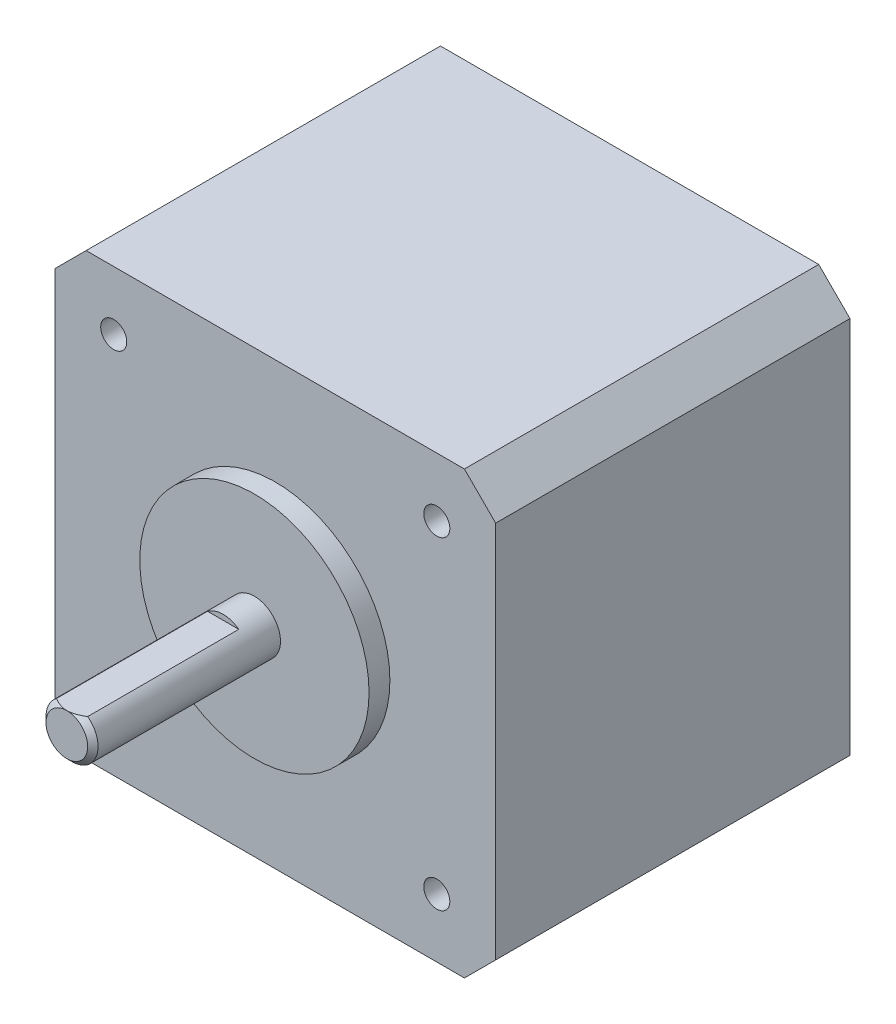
ISO-10303-21;
HEADER;
FILE_DESCRIPTION(('STEP AP214'),'2;1');
FILE_NAME('part.step','',(''),(''),'','','');
FILE_SCHEMA(('AUTOMOTIVE_DESIGN { 1 0 10303 214 1 1 1 1 }'));
ENDSEC;
DATA;
#1=APPLICATION_CONTEXT('core data for automotive mechanical design processes');
#2=APPLICATION_PROTOCOL_DEFINITION('international standard','automotive_design',2000,#1);
#3=PRODUCT_CONTEXT('',#1,'mechanical');
#4=PRODUCT('Part','Part','',(#3));
#5=PRODUCT_RELATED_PRODUCT_CATEGORY('part','',(#4));
#6=PRODUCT_DEFINITION_FORMATION('','',#4);
#7=PRODUCT_DEFINITION_CONTEXT('part definition',#1,'design');
#8=PRODUCT_DEFINITION('design','',#6,#7);
#9=PRODUCT_DEFINITION_SHAPE('','',#8);
#10=(LENGTH_UNIT() NAMED_UNIT(*) SI_UNIT(.MILLI.,.METRE.));
#11=(NAMED_UNIT(*) PLANE_ANGLE_UNIT() SI_UNIT($,.RADIAN.));
#12=(NAMED_UNIT(*) SI_UNIT($,.STERADIAN.) SOLID_ANGLE_UNIT());
#13=UNCERTAINTY_MEASURE_WITH_UNIT(LENGTH_MEASURE(1.E-05),#10,'distance_accuracy_value','');
#14=(GEOMETRIC_REPRESENTATION_CONTEXT(3) GLOBAL_UNCERTAINTY_ASSIGNED_CONTEXT((#13)) GLOBAL_UNIT_ASSIGNED_CONTEXT((#10,
#11,#12)) REPRESENTATION_CONTEXT('',''));
#15=CARTESIAN_POINT('',(0.,0.,0.));
#16=DIRECTION('',(0.,0.,1.));
#17=DIRECTION('',(1.,0.,0.));
#18=AXIS2_PLACEMENT_3D('',#15,#16,#17);
#19=CARTESIAN_POINT('',(0.,0.,0.));
#20=DIRECTION('',(0.,0.,1.));
#21=DIRECTION('',(1.,0.,0.));
#22=AXIS2_PLACEMENT_3D('',#19,#20,#21);
#23=PLANE('',#22);
#24=CARTESIAN_POINT('',(0.,0.,0.));
#25=DIRECTION('',(0.,0.,1.));
#26=DIRECTION('',(1.,0.,0.));
#27=AXIS2_PLACEMENT_3D('',#24,#25,#26);
#28=CIRCLE('',#27,11.);
#29=CARTESIAN_POINT('',(11.,0.,0.));
#30=VERTEX_POINT('',#29);
#31=EDGE_CURVE('E232',#30,#30,#28,.T.);
#32=ORIENTED_EDGE('',*,*,#31,.T.);
#33=EDGE_LOOP('',(#32));
#34=FACE_BOUND('',#33,.T.);
#35=CARTESIAN_POINT('',(0.,0.,0.));
#36=DIRECTION('',(0.,0.,1.));
#37=DIRECTION('',(1.,0.,0.));
#38=AXIS2_PLACEMENT_3D('',#35,#36,#37);
#39=CIRCLE('',#38,2.5);
#40=CARTESIAN_POINT('',(2.5,0.,0.));
#41=VERTEX_POINT('',#40);
#42=EDGE_CURVE('E229',#41,#41,#39,.T.);
#43=ORIENTED_EDGE('',*,*,#42,.F.);
#44=EDGE_LOOP('',(#43));
#45=FACE_BOUND('',#44,.T.);
#46=ADVANCED_FACE('F39',(#34,#45),#23,.T.);
#47=CARTESIAN_POINT('',(0.,0.,-2.));
#48=DIRECTION('',(0.,0.,1.));
#49=DIRECTION('',(1.,0.,0.));
#50=AXIS2_PLACEMENT_3D('',#47,#48,#49);
#51=CYLINDRICAL_SURFACE('',#50,11.);
#52=CARTESIAN_POINT('',(0.,0.,-2.));
#53=DIRECTION('',(0.,0.,1.));
#54=DIRECTION('',(1.,0.,0.));
#55=AXIS2_PLACEMENT_3D('',#52,#53,#54);
#56=CIRCLE('',#55,11.);
#57=CARTESIAN_POINT('',(11.,0.,-2.));
#58=VERTEX_POINT('',#57);
#59=EDGE_CURVE('E219',#58,#58,#56,.F.);
#60=ORIENTED_EDGE('',*,*,#59,.F.);
#61=EDGE_LOOP('',(#60));
#62=FACE_BOUND('',#61,.T.);
#63=ORIENTED_EDGE('',*,*,#31,.F.);
#64=EDGE_LOOP('',(#63));
#65=FACE_BOUND('',#64,.T.);
#66=ADVANCED_FACE('F264',(#62,#65),#51,.T.);
#67=CARTESIAN_POINT('',(0.,0.,18.));
#68=DIRECTION('',(0.,0.,-1.));
#69=DIRECTION('',(-1.,0.,0.));
#70=AXIS2_PLACEMENT_3D('',#67,#68,#69);
#71=CYLINDRICAL_SURFACE('',#70,2.5);
#72=DIRECTION('',(0.,0.,-1.));
#73=VECTOR('',#72,1.);
#74=CARTESIAN_POINT('',(1.5,2.,18.));
#75=LINE('',#74,#73);
#76=CARTESIAN_POINT('',(1.5,2.,3.));
#77=VERTEX_POINT('',#76);
#78=CARTESIAN_POINT('',(1.5,2.,17.5));
#79=VERTEX_POINT('',#78);
#80=EDGE_CURVE('E225',#77,#79,#75,.F.);
#81=ORIENTED_EDGE('',*,*,#80,.T.);
#82=CARTESIAN_POINT('',(0.,0.,17.5));
#83=DIRECTION('',(0.,0.,1.));
#84=DIRECTION('',(1.,0.,0.));
#85=AXIS2_PLACEMENT_3D('',#82,#83,#84);
#86=CIRCLE('',#85,2.5);
#87=CARTESIAN_POINT('',(-1.5,2.,17.5));
#88=VERTEX_POINT('',#87);
#89=EDGE_CURVE('E11',#79,#88,#86,.F.);
#90=ORIENTED_EDGE('',*,*,#89,.T.);
#91=DIRECTION('',(0.,0.,-1.));
#92=VECTOR('',#91,1.);
#93=CARTESIAN_POINT('',(-1.5,2.,18.));
#94=LINE('',#93,#92);
#95=CARTESIAN_POINT('',(-1.5,2.,3.));
#96=VERTEX_POINT('',#95);
#97=EDGE_CURVE('E227',#88,#96,#94,.T.);
#98=ORIENTED_EDGE('',*,*,#97,.T.);
#99=CARTESIAN_POINT('',(0.,0.,3.));
#100=DIRECTION('',(0.,0.,1.));
#101=DIRECTION('',(1.,0.,0.));
#102=AXIS2_PLACEMENT_3D('',#99,#100,#101);
#103=CIRCLE('',#102,2.5);
#104=EDGE_CURVE('E235',#77,#96,#103,.T.);
#105=ORIENTED_EDGE('',*,*,#104,.F.);
#106=EDGE_LOOP('',(#81,#90,#98,#105));
#107=FACE_BOUND('',#106,.T.);
#108=ORIENTED_EDGE('',*,*,#42,.T.);
#109=EDGE_LOOP('',(#108));
#110=FACE_BOUND('',#109,.T.);
#111=ADVANCED_FACE('F260',(#107,#110),#71,.T.);
#112=CARTESIAN_POINT('',(0.,0.,18.));
#113=DIRECTION('',(0.,0.,1.));
#114=DIRECTION('',(1.,0.,0.));
#115=AXIS2_PLACEMENT_3D('',#112,#113,#114);
#116=PLANE('',#115);
#117=CARTESIAN_POINT('',(0.,0.,18.));
#118=DIRECTION('',(0.,0.,1.));
#119=DIRECTION('',(1.,0.,0.));
#120=AXIS2_PLACEMENT_3D('',#117,#118,#119);
#121=CIRCLE('',#120,2.00000000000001);
#122=CARTESIAN_POINT('',(0.,2.,18.));
#123=VERTEX_POINT('',#122);
#124=EDGE_CURVE('E238',#123,#123,#121,.T.);
#125=ORIENTED_EDGE('',*,*,#124,.T.);
#126=EDGE_LOOP('',(#125));
#127=FACE_BOUND('',#126,.T.);
#128=ADVANCED_FACE('F256',(#127),#116,.T.);
#129=CARTESIAN_POINT('',(0.,0.,3.));
#130=DIRECTION('',(0.,0.,1.));
#131=DIRECTION('',(1.,0.,0.));
#132=AXIS2_PLACEMENT_3D('',#129,#130,#131);
#133=PLANE('',#132);
#134=ORIENTED_EDGE('',*,*,#104,.T.);
#135=DIRECTION('',(1.,0.,0.));
#136=VECTOR('',#135,1.);
#137=CARTESIAN_POINT('',(-2.5,2.,3.));
#138=LINE('',#137,#136);
#139=EDGE_CURVE('E222',#96,#77,#138,.T.);
#140=ORIENTED_EDGE('',*,*,#139,.T.);
#141=EDGE_LOOP('',(#134,#140));
#142=FACE_BOUND('',#141,.T.);
#143=ADVANCED_FACE('F254',(#142),#133,.T.);
#144=CARTESIAN_POINT('',(0.,2.,3.));
#145=DIRECTION('',(0.,-1.,0.));
#146=DIRECTION('',(0.,0.,-1.));
#147=AXIS2_PLACEMENT_3D('',#144,#145,#146);
#148=PLANE('',#147);
#149=CARTESIAN_POINT('',(-1.5,2.,17.5));
#150=CARTESIAN_POINT('',(-1.42763018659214,2.,17.5433736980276));
#151=CARTESIAN_POINT('',(-1.35436226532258,2.,17.5853687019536));
#152=CARTESIAN_POINT('',(-1.20549660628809,2.,17.6656443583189));
#153=CARTESIAN_POINT('',(-1.12989157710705,2.,17.7039114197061));
#154=CARTESIAN_POINT('',(-0.978296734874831,2.,17.774534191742));
#155=CARTESIAN_POINT('',(-0.902366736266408,2.,17.8070165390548));
#156=CARTESIAN_POINT('',(-0.748220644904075,2.,17.8658090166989));
#157=CARTESIAN_POINT('',(-0.670007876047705,2.,17.8921276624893));
#158=CARTESIAN_POINT('',(-0.543060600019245,2.,17.9280861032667));
#159=CARTESIAN_POINT('',(-0.495021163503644,2.,17.9401901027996));
#160=CARTESIAN_POINT('',(-0.398260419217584,2.,17.9612794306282));
#161=CARTESIAN_POINT('',(-0.349539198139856,2.,17.9702651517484));
#162=CARTESIAN_POINT('',(-0.250852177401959,2.,17.984927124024));
#163=CARTESIAN_POINT('',(-0.20087865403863,2.,17.9905520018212));
#164=CARTESIAN_POINT('',(-0.100607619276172,2.,17.9981023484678));
#165=CARTESIAN_POINT('',(-0.0503098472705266,2.,18.0000243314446));
#166=CARTESIAN_POINT('',(0.,2.,18.));
#167=B_SPLINE_CURVE_WITH_KNOTS('',3,(#149,#150,#151,#152,#153,#154,#155,#156,#157,#158,#159,
#160,#161,#162,#163,#164,#165,#166),.UNSPECIFIED.,.F.,.F.,(4,2,2,2,2,2,2,2,4),(0.,
0.253195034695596,0.507281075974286,0.754837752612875,1.00205037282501,1.15058504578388,
1.29910100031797,1.44983263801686,1.600706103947),.UNSPECIFIED.);
#168=EDGE_CURVE('E241',#88,#123,#167,.T.);
#169=ORIENTED_EDGE('',*,*,#168,.T.);
#170=CARTESIAN_POINT('',(0.,2.00000000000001,18.));
#171=CARTESIAN_POINT('',(0.0614966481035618,2.,18.0000514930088));
#172=CARTESIAN_POINT('',(0.122961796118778,2.,17.997164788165));
#173=CARTESIAN_POINT('',(0.245274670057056,2.,17.9859212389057));
#174=CARTESIAN_POINT('',(0.306123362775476,2.,17.9775750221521));
#175=CARTESIAN_POINT('',(0.425885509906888,2.,17.9559969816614));
#176=CARTESIAN_POINT('',(0.484814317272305,2.,17.9428488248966));
#177=CARTESIAN_POINT('',(0.601555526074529,2.,17.9122507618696));
#178=CARTESIAN_POINT('',(0.659367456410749,2.,17.8947990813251));
#179=CARTESIAN_POINT('',(0.784576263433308,2.,17.8525702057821));
#180=CARTESIAN_POINT('',(0.851714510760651,2.,17.8270315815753));
#181=CARTESIAN_POINT('',(0.984250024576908,2.,17.7717452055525));
#182=CARTESIAN_POINT('',(1.04964642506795,2.,17.7419954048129));
#183=CARTESIAN_POINT('',(1.18016546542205,2.,17.6784785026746));
#184=CARTESIAN_POINT('',(1.24525271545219,2.,17.6446394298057));
#185=CARTESIAN_POINT('',(1.37378197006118,2.,17.5742160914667));
#186=CARTESIAN_POINT('',(1.43722666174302,2.,17.5376367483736));
#187=CARTESIAN_POINT('',(1.5,2.,17.5));
#188=B_SPLINE_CURVE_WITH_KNOTS('',3,(#170,#171,#172,#173,#174,#175,#176,#177,#178,#179,#180,
#181,#182,#183,#184,#185,#186,#187),.UNSPECIFIED.,.F.,.F.,(4,2,2,2,2,2,2,2,4),(0.,
0.184371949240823,0.368386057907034,0.549336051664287,0.730360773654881,0.945674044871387,
1.16109243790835,1.38109142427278,1.60070428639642),.UNSPECIFIED.);
#189=EDGE_CURVE('E48',#123,#79,#188,.T.);
#190=ORIENTED_EDGE('',*,*,#189,.T.);
#191=ORIENTED_EDGE('',*,*,#80,.F.);
#192=ORIENTED_EDGE('',*,*,#139,.F.);
#193=ORIENTED_EDGE('',*,*,#97,.F.);
#194=EDGE_LOOP('',(#169,#190,#191,#192,#193));
#195=FACE_BOUND('',#194,.T.);
#196=ADVANCED_FACE('F249',(#195),#148,.F.);
#197=CARTESIAN_POINT('',(0.,0.,18.));
#198=DIRECTION('',(0.,0.,-1.));
#199=DIRECTION('',(-1.,0.,0.));
#200=AXIS2_PLACEMENT_3D('',#197,#198,#199);
#201=CONICAL_SURFACE('',#200,2.00000000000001,0.785398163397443);
#202=ORIENTED_EDGE('',*,*,#168,.F.);
#203=ORIENTED_EDGE('',*,*,#89,.F.);
#204=ORIENTED_EDGE('',*,*,#189,.F.);
#205=ORIENTED_EDGE('',*,*,#124,.F.);
#206=EDGE_LOOP('',(#202,#203,#204,#205));
#207=FACE_BOUND('',#206,.T.);
#208=ADVANCED_FACE('F41',(#207),#201,.T.);
#209=CARTESIAN_POINT('',(21.15,-18.15,-36.));
#210=DIRECTION('',(-1.,0.,0.));
#211=DIRECTION('',(0.,0.,1.));
#212=AXIS2_PLACEMENT_3D('',#209,#210,#211);
#213=PLANE('',#212);
#214=DIRECTION('',(0.,-1.,0.));
#215=VECTOR('',#214,1.);
#216=CARTESIAN_POINT('',(21.15,-18.15,-2.));
#217=LINE('',#216,#215);
#218=CARTESIAN_POINT('',(21.15,18.15,-2.));
#219=VERTEX_POINT('',#218);
#220=CARTESIAN_POINT('',(21.15,-18.15,-2.));
#221=VERTEX_POINT('',#220);
#222=EDGE_CURVE('E160',#219,#221,#217,.T.);
#223=ORIENTED_EDGE('',*,*,#222,.T.);
#224=DIRECTION('',(0.,0.,1.));
#225=VECTOR('',#224,1.);
#226=CARTESIAN_POINT('',(21.15,-18.15,-36.));
#227=LINE('',#226,#225);
#228=CARTESIAN_POINT('',(21.15,-18.15,-36.));
#229=VERTEX_POINT('',#228);
#230=EDGE_CURVE('E216',#229,#221,#227,.T.);
#231=ORIENTED_EDGE('',*,*,#230,.F.);
#232=DIRECTION('',(0.,-1.,0.));
#233=VECTOR('',#232,1.);
#234=CARTESIAN_POINT('',(21.15,-18.15,-36.));
#235=LINE('',#234,#233);
#236=CARTESIAN_POINT('',(21.15,18.15,-36.));
#237=VERTEX_POINT('',#236);
#238=EDGE_CURVE('E161',#237,#229,#235,.T.);
#239=ORIENTED_EDGE('',*,*,#238,.F.);
#240=DIRECTION('',(0.,0.,1.));
#241=VECTOR('',#240,1.);
#242=CARTESIAN_POINT('',(21.15,18.15,-36.));
#243=LINE('',#242,#241);
#244=EDGE_CURVE('E179',#237,#219,#243,.T.);
#245=ORIENTED_EDGE('',*,*,#244,.T.);
#246=EDGE_LOOP('',(#223,#231,#239,#245));
#247=FACE_BOUND('',#246,.T.);
#248=ADVANCED_FACE('F290',(#247),#213,.F.);
#249=CARTESIAN_POINT('',(18.15,-21.15,-36.));
#250=DIRECTION('',(-0.707106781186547,0.707106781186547,0.));
#251=DIRECTION('',(-0.707106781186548,-0.707106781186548,0.));
#252=AXIS2_PLACEMENT_3D('',#249,#250,#251);
#253=PLANE('',#252);
#254=DIRECTION('',(-0.707106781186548,-0.707106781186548,0.));
#255=VECTOR('',#254,1.);
#256=CARTESIAN_POINT('',(18.15,-21.15,-2.));
#257=LINE('',#256,#255);
#258=CARTESIAN_POINT('',(18.15,-21.15,-2.));
#259=VERTEX_POINT('',#258);
#260=EDGE_CURVE('E182',#221,#259,#257,.T.);
#261=ORIENTED_EDGE('',*,*,#260,.T.);
#262=DIRECTION('',(0.,0.,1.));
#263=VECTOR('',#262,1.);
#264=CARTESIAN_POINT('',(18.15,-21.15,-36.));
#265=LINE('',#264,#263);
#266=CARTESIAN_POINT('',(18.15,-21.15,-36.));
#267=VERTEX_POINT('',#266);
#268=EDGE_CURVE('E213',#267,#259,#265,.T.);
#269=ORIENTED_EDGE('',*,*,#268,.F.);
#270=DIRECTION('',(-0.707106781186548,-0.707106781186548,0.));
#271=VECTOR('',#270,1.);
#272=CARTESIAN_POINT('',(18.15,-21.15,-36.));
#273=LINE('',#272,#271);
#274=EDGE_CURVE('E164',#229,#267,#273,.T.);
#275=ORIENTED_EDGE('',*,*,#274,.F.);
#276=ORIENTED_EDGE('',*,*,#230,.T.);
#277=EDGE_LOOP('',(#261,#269,#275,#276));
#278=FACE_BOUND('',#277,.T.);
#279=ADVANCED_FACE('F321',(#278),#253,.F.);
#280=CARTESIAN_POINT('',(-18.15,-21.15,-36.));
#281=DIRECTION('',(0.,1.,0.));
#282=DIRECTION('',(-1.,0.,0.));
#283=AXIS2_PLACEMENT_3D('',#280,#281,#282);
#284=PLANE('',#283);
#285=DIRECTION('',(-1.,0.,0.));
#286=VECTOR('',#285,1.);
#287=CARTESIAN_POINT('',(-18.15,-21.15,-2.));
#288=LINE('',#287,#286);
#289=CARTESIAN_POINT('',(-18.15,-21.15,-2.));
#290=VERTEX_POINT('',#289);
#291=EDGE_CURVE('E184',#259,#290,#288,.T.);
#292=ORIENTED_EDGE('',*,*,#291,.T.);
#293=DIRECTION('',(0.,0.,1.));
#294=VECTOR('',#293,1.);
#295=CARTESIAN_POINT('',(-18.15,-21.15,-36.));
#296=LINE('',#295,#294);
#297=CARTESIAN_POINT('',(-18.15,-21.15,-36.));
#298=VERTEX_POINT('',#297);
#299=EDGE_CURVE('E210',#298,#290,#296,.T.);
#300=ORIENTED_EDGE('',*,*,#299,.F.);
#301=DIRECTION('',(-1.,0.,0.));
#302=VECTOR('',#301,1.);
#303=CARTESIAN_POINT('',(-18.15,-21.15,-36.));
#304=LINE('',#303,#302);
#305=EDGE_CURVE('E167',#267,#298,#304,.T.);
#306=ORIENTED_EDGE('',*,*,#305,.F.);
#307=ORIENTED_EDGE('',*,*,#268,.T.);
#308=EDGE_LOOP('',(#292,#300,#306,#307));
#309=FACE_BOUND('',#308,.T.);
#310=ADVANCED_FACE('F318',(#309),#284,.F.);
#311=CARTESIAN_POINT('',(-21.15,-18.15,-36.));
#312=DIRECTION('',(0.707106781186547,0.707106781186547,0.));
#313=DIRECTION('',(-0.707106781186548,0.707106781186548,0.));
#314=AXIS2_PLACEMENT_3D('',#311,#312,#313);
#315=PLANE('',#314);
#316=DIRECTION('',(-0.707106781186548,0.707106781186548,0.));
#317=VECTOR('',#316,1.);
#318=CARTESIAN_POINT('',(-21.15,-18.15,-2.));
#319=LINE('',#318,#317);
#320=CARTESIAN_POINT('',(-21.15,-18.15,-2.));
#321=VERTEX_POINT('',#320);
#322=EDGE_CURVE('E186',#290,#321,#319,.T.);
#323=ORIENTED_EDGE('',*,*,#322,.T.);
#324=DIRECTION('',(0.,0.,1.));
#325=VECTOR('',#324,1.);
#326=CARTESIAN_POINT('',(-21.15,-18.15,-36.));
#327=LINE('',#326,#325);
#328=CARTESIAN_POINT('',(-21.15,-18.15,-36.));
#329=VERTEX_POINT('',#328);
#330=EDGE_CURVE('E207',#329,#321,#327,.T.);
#331=ORIENTED_EDGE('',*,*,#330,.F.);
#332=DIRECTION('',(-0.707106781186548,0.707106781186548,0.));
#333=VECTOR('',#332,1.);
#334=CARTESIAN_POINT('',(-21.15,-18.15,-36.));
#335=LINE('',#334,#333);
#336=EDGE_CURVE('E169',#298,#329,#335,.T.);
#337=ORIENTED_EDGE('',*,*,#336,.F.);
#338=ORIENTED_EDGE('',*,*,#299,.T.);
#339=EDGE_LOOP('',(#323,#331,#337,#338));
#340=FACE_BOUND('',#339,.T.);
#341=ADVANCED_FACE('F313',(#340),#315,.F.);
#342=CARTESIAN_POINT('',(-21.15,18.15,-36.));
#343=DIRECTION('',(1.,0.,0.));
#344=DIRECTION('',(0.,1.,0.));
#345=AXIS2_PLACEMENT_3D('',#342,#343,#344);
#346=PLANE('',#345);
#347=DIRECTION('',(0.,1.,0.));
#348=VECTOR('',#347,1.);
#349=CARTESIAN_POINT('',(-21.15,18.15,-2.));
#350=LINE('',#349,#348);
#351=CARTESIAN_POINT('',(-21.15,18.15,-2.));
#352=VERTEX_POINT('',#351);
#353=EDGE_CURVE('E188',#321,#352,#350,.T.);
#354=ORIENTED_EDGE('',*,*,#353,.T.);
#355=DIRECTION('',(0.,0.,1.));
#356=VECTOR('',#355,1.);
#357=CARTESIAN_POINT('',(-21.15,18.15,-36.));
#358=LINE('',#357,#356);
#359=CARTESIAN_POINT('',(-21.15,18.15,-36.));
#360=VERTEX_POINT('',#359);
#361=EDGE_CURVE('E204',#360,#352,#358,.T.);
#362=ORIENTED_EDGE('',*,*,#361,.F.);
#363=DIRECTION('',(0.,1.,0.));
#364=VECTOR('',#363,1.);
#365=CARTESIAN_POINT('',(-21.15,18.15,-36.));
#366=LINE('',#365,#364);
#367=EDGE_CURVE('E171',#329,#360,#366,.T.);
#368=ORIENTED_EDGE('',*,*,#367,.F.);
#369=ORIENTED_EDGE('',*,*,#330,.T.);
#370=EDGE_LOOP('',(#354,#362,#368,#369));
#371=FACE_BOUND('',#370,.T.);
#372=ADVANCED_FACE('F309',(#371),#346,.F.);
#373=CARTESIAN_POINT('',(-18.15,21.15,-36.));
#374=DIRECTION('',(0.707106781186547,-0.707106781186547,0.));
#375=DIRECTION('',(0.707106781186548,0.707106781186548,0.));
#376=AXIS2_PLACEMENT_3D('',#373,#374,#375);
#377=PLANE('',#376);
#378=DIRECTION('',(0.707106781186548,0.707106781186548,0.));
#379=VECTOR('',#378,1.);
#380=CARTESIAN_POINT('',(-18.15,21.15,-2.));
#381=LINE('',#380,#379);
#382=CARTESIAN_POINT('',(-18.15,21.15,-2.));
#383=VERTEX_POINT('',#382);
#384=EDGE_CURVE('E190',#352,#383,#381,.T.);
#385=ORIENTED_EDGE('',*,*,#384,.T.);
#386=DIRECTION('',(0.,0.,1.));
#387=VECTOR('',#386,1.);
#388=CARTESIAN_POINT('',(-18.15,21.15,-36.));
#389=LINE('',#388,#387);
#390=CARTESIAN_POINT('',(-18.15,21.15,-36.));
#391=VERTEX_POINT('',#390);
#392=EDGE_CURVE('E201',#391,#383,#389,.T.);
#393=ORIENTED_EDGE('',*,*,#392,.F.);
#394=DIRECTION('',(0.707106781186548,0.707106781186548,0.));
#395=VECTOR('',#394,1.);
#396=CARTESIAN_POINT('',(-18.15,21.15,-36.));
#397=LINE('',#396,#395);
#398=EDGE_CURVE('E173',#360,#391,#397,.T.);
#399=ORIENTED_EDGE('',*,*,#398,.F.);
#400=ORIENTED_EDGE('',*,*,#361,.T.);
#401=EDGE_LOOP('',(#385,#393,#399,#400));
#402=FACE_BOUND('',#401,.T.);
#403=ADVANCED_FACE('F304',(#402),#377,.F.);
#404=CARTESIAN_POINT('',(18.15,21.15,-36.));
#405=DIRECTION('',(0.,-1.,0.));
#406=DIRECTION('',(0.,0.,-1.));
#407=AXIS2_PLACEMENT_3D('',#404,#405,#406);
#408=PLANE('',#407);
#409=DIRECTION('',(1.,0.,0.));
#410=VECTOR('',#409,1.);
#411=CARTESIAN_POINT('',(18.15,21.15,-2.));
#412=LINE('',#411,#410);
#413=CARTESIAN_POINT('',(18.15,21.15,-2.));
#414=VERTEX_POINT('',#413);
#415=EDGE_CURVE('E193',#383,#414,#412,.T.);
#416=ORIENTED_EDGE('',*,*,#415,.T.);
#417=DIRECTION('',(0.,0.,1.));
#418=VECTOR('',#417,1.);
#419=CARTESIAN_POINT('',(18.15,21.15,-36.));
#420=LINE('',#419,#418);
#421=CARTESIAN_POINT('',(18.15,21.15,-36.));
#422=VERTEX_POINT('',#421);
#423=EDGE_CURVE('E198',#422,#414,#420,.T.);
#424=ORIENTED_EDGE('',*,*,#423,.F.);
#425=DIRECTION('',(1.,0.,0.));
#426=VECTOR('',#425,1.);
#427=CARTESIAN_POINT('',(0.,21.15,-36.));
#428=LINE('',#427,#426);
#429=EDGE_CURVE('E175',#391,#422,#428,.T.);
#430=ORIENTED_EDGE('',*,*,#429,.F.);
#431=ORIENTED_EDGE('',*,*,#392,.T.);
#432=EDGE_LOOP('',(#416,#424,#430,#431));
#433=FACE_BOUND('',#432,.T.);
#434=ADVANCED_FACE('F299',(#433),#408,.F.);
#435=CARTESIAN_POINT('',(21.15,18.15,-36.));
#436=DIRECTION('',(-0.707106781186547,-0.707106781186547,0.));
#437=DIRECTION('',(0.707106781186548,-0.707106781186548,0.));
#438=AXIS2_PLACEMENT_3D('',#435,#436,#437);
#439=PLANE('',#438);
#440=DIRECTION('',(0.707106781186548,-0.707106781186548,0.));
#441=VECTOR('',#440,1.);
#442=CARTESIAN_POINT('',(21.15,18.15,-2.));
#443=LINE('',#442,#441);
#444=EDGE_CURVE('E165',#414,#219,#443,.T.);
#445=ORIENTED_EDGE('',*,*,#444,.T.);
#446=ORIENTED_EDGE('',*,*,#244,.F.);
#447=DIRECTION('',(0.707106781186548,-0.707106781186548,0.));
#448=VECTOR('',#447,1.);
#449=CARTESIAN_POINT('',(21.15,18.15,-36.));
#450=LINE('',#449,#448);
#451=EDGE_CURVE('E177',#422,#237,#450,.T.);
#452=ORIENTED_EDGE('',*,*,#451,.F.);
#453=ORIENTED_EDGE('',*,*,#423,.T.);
#454=EDGE_LOOP('',(#445,#446,#452,#453));
#455=FACE_BOUND('',#454,.T.);
#456=ADVANCED_FACE('F295',(#455),#439,.F.);
#457=CARTESIAN_POINT('',(0.,0.,-36.));
#458=DIRECTION('',(0.,0.,1.));
#459=DIRECTION('',(1.,0.,0.));
#460=AXIS2_PLACEMENT_3D('',#457,#458,#459);
#461=PLANE('',#460);
#462=ORIENTED_EDGE('',*,*,#238,.T.);
#463=ORIENTED_EDGE('',*,*,#274,.T.);
#464=ORIENTED_EDGE('',*,*,#305,.T.);
#465=ORIENTED_EDGE('',*,*,#336,.T.);
#466=ORIENTED_EDGE('',*,*,#367,.T.);
#467=ORIENTED_EDGE('',*,*,#398,.T.);
#468=ORIENTED_EDGE('',*,*,#429,.T.);
#469=ORIENTED_EDGE('',*,*,#451,.T.);
#470=EDGE_LOOP('',(#462,#463,#464,#465,#466,#467,#468,#469));
#471=FACE_BOUND('',#470,.T.);
#472=ADVANCED_FACE('F282',(#471),#461,.F.);
#473=CARTESIAN_POINT('',(0.,0.,-2.));
#474=DIRECTION('',(0.,0.,1.));
#475=DIRECTION('',(1.,0.,0.));
#476=AXIS2_PLACEMENT_3D('',#473,#474,#475);
#477=PLANE('',#476);
#478=CARTESIAN_POINT('',(-15.5,15.5,-2.));
#479=DIRECTION('',(0.,0.,1.));
#480=DIRECTION('',(1.,0.,0.));
#481=AXIS2_PLACEMENT_3D('',#478,#479,#480);
#482=CIRCLE('',#481,1.24999999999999);
#483=CARTESIAN_POINT('',(-14.25,15.5,-2.));
#484=VERTEX_POINT('',#483);
#485=EDGE_CURVE('E138',#484,#484,#482,.T.);
#486=ORIENTED_EDGE('',*,*,#485,.F.);
#487=EDGE_LOOP('',(#486));
#488=FACE_BOUND('',#487,.T.);
#489=CARTESIAN_POINT('',(15.5,15.5,-2.));
#490=DIRECTION('',(0.,0.,1.));
#491=DIRECTION('',(1.,0.,0.));
#492=AXIS2_PLACEMENT_3D('',#489,#490,#491);
#493=CIRCLE('',#492,1.24999999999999);
#494=CARTESIAN_POINT('',(16.75,15.5,-2.));
#495=VERTEX_POINT('',#494);
#496=EDGE_CURVE('E137',#495,#495,#493,.T.);
#497=ORIENTED_EDGE('',*,*,#496,.F.);
#498=EDGE_LOOP('',(#497));
#499=FACE_BOUND('',#498,.T.);
#500=CARTESIAN_POINT('',(15.5,-15.5,-2.));
#501=DIRECTION('',(0.,0.,1.));
#502=DIRECTION('',(1.,0.,0.));
#503=AXIS2_PLACEMENT_3D('',#500,#501,#502);
#504=CIRCLE('',#503,1.24999999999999);
#505=CARTESIAN_POINT('',(16.75,-15.5,-2.));
#506=VERTEX_POINT('',#505);
#507=EDGE_CURVE('E148',#506,#506,#504,.T.);
#508=ORIENTED_EDGE('',*,*,#507,.F.);
#509=EDGE_LOOP('',(#508));
#510=FACE_BOUND('',#509,.T.);
#511=CARTESIAN_POINT('',(-15.5,-15.5,-2.));
#512=DIRECTION('',(0.,0.,1.));
#513=DIRECTION('',(1.,0.,0.));
#514=AXIS2_PLACEMENT_3D('',#511,#512,#513);
#515=CIRCLE('',#514,1.24999999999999);
#516=CARTESIAN_POINT('',(-14.25,-15.5,-2.));
#517=VERTEX_POINT('',#516);
#518=EDGE_CURVE('E154',#517,#517,#515,.T.);
#519=ORIENTED_EDGE('',*,*,#518,.F.);
#520=EDGE_LOOP('',(#519));
#521=FACE_BOUND('',#520,.T.);
#522=ORIENTED_EDGE('',*,*,#59,.T.);
#523=EDGE_LOOP('',(#522));
#524=FACE_BOUND('',#523,.T.);
#525=ORIENTED_EDGE('',*,*,#222,.F.);
#526=ORIENTED_EDGE('',*,*,#444,.F.);
#527=ORIENTED_EDGE('',*,*,#415,.F.);
#528=ORIENTED_EDGE('',*,*,#384,.F.);
#529=ORIENTED_EDGE('',*,*,#353,.F.);
#530=ORIENTED_EDGE('',*,*,#322,.F.);
#531=ORIENTED_EDGE('',*,*,#291,.F.);
#532=ORIENTED_EDGE('',*,*,#260,.F.);
#533=EDGE_LOOP('',(#525,#526,#527,#528,#529,#530,#531,#532));
#534=FACE_BOUND('',#533,.T.);
#535=ADVANCED_FACE('F278',(#488,#499,#510,#521,#524,#534),#477,.T.);
#536=CARTESIAN_POINT('',(-15.5,-15.5,-9.));
#537=DIRECTION('',(0.,0.,1.));
#538=DIRECTION('',(1.,0.,0.));
#539=AXIS2_PLACEMENT_3D('',#536,#537,#538);
#540=CONICAL_SURFACE('',#539,1.25,1.02974425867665);
#541=CARTESIAN_POINT('',(-15.5,-15.5,-9.75107577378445));
#542=VERTEX_POINT('',#541);
#543=VERTEX_LOOP('',#542);
#544=FACE_BOUND('',#543,.T.);
#545=CARTESIAN_POINT('',(-15.5,-15.5,-9.));
#546=DIRECTION('',(0.,0.,1.));
#547=DIRECTION('',(1.,0.,0.));
#548=AXIS2_PLACEMENT_3D('',#545,#546,#547);
#549=CIRCLE('',#548,1.25);
#550=CARTESIAN_POINT('',(-14.25,-15.5,-9.));
#551=VERTEX_POINT('',#550);
#552=EDGE_CURVE('E157',#551,#551,#549,.T.);
#553=ORIENTED_EDGE('',*,*,#552,.T.);
#554=EDGE_LOOP('',(#553));
#555=FACE_BOUND('',#554,.T.);
#556=ADVANCED_FACE('F281',(#544,#555),#540,.F.);
#557=CARTESIAN_POINT('',(-15.5,-15.5,-2.));
#558=DIRECTION('',(0.,0.,1.));
#559=DIRECTION('',(1.,0.,0.));
#560=AXIS2_PLACEMENT_3D('',#557,#558,#559);
#561=CYLINDRICAL_SURFACE('',#560,1.24999999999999);
#562=ORIENTED_EDGE('',*,*,#552,.F.);
#563=EDGE_LOOP('',(#562));
#564=FACE_BOUND('',#563,.T.);
#565=ORIENTED_EDGE('',*,*,#518,.T.);
#566=EDGE_LOOP('',(#565));
#567=FACE_BOUND('',#566,.T.);
#568=ADVANCED_FACE('F439',(#564,#567),#561,.F.);
#569=CARTESIAN_POINT('',(15.5,-15.5,-9.));
#570=DIRECTION('',(0.,0.,1.));
#571=DIRECTION('',(1.,0.,0.));
#572=AXIS2_PLACEMENT_3D('',#569,#570,#571);
#573=CONICAL_SURFACE('',#572,1.25,1.02974425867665);
#574=CARTESIAN_POINT('',(15.5,-15.5,-9.75107577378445));
#575=VERTEX_POINT('',#574);
#576=VERTEX_LOOP('',#575);
#577=FACE_BOUND('',#576,.T.);
#578=CARTESIAN_POINT('',(15.5,-15.5,-9.));
#579=DIRECTION('',(0.,0.,1.));
#580=DIRECTION('',(1.,0.,0.));
#581=AXIS2_PLACEMENT_3D('',#578,#579,#580);
#582=CIRCLE('',#581,1.25);
#583=CARTESIAN_POINT('',(16.75,-15.5,-9.));
#584=VERTEX_POINT('',#583);
#585=EDGE_CURVE('E151',#584,#584,#582,.T.);
#586=ORIENTED_EDGE('',*,*,#585,.T.);
#587=EDGE_LOOP('',(#586));
#588=FACE_BOUND('',#587,.T.);
#589=ADVANCED_FACE('F449',(#577,#588),#573,.F.);
#590=CARTESIAN_POINT('',(15.5,-15.5,-2.));
#591=DIRECTION('',(0.,0.,1.));
#592=DIRECTION('',(1.,0.,0.));
#593=AXIS2_PLACEMENT_3D('',#590,#591,#592);
#594=CYLINDRICAL_SURFACE('',#593,1.24999999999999);
#595=ORIENTED_EDGE('',*,*,#585,.F.);
#596=EDGE_LOOP('',(#595));
#597=FACE_BOUND('',#596,.T.);
#598=ORIENTED_EDGE('',*,*,#507,.T.);
#599=EDGE_LOOP('',(#598));
#600=FACE_BOUND('',#599,.T.);
#601=ADVANCED_FACE('F460',(#597,#600),#594,.F.);
#602=CARTESIAN_POINT('',(15.5,15.5,-9.));
#603=DIRECTION('',(0.,0.,1.));
#604=DIRECTION('',(1.,0.,0.));
#605=AXIS2_PLACEMENT_3D('',#602,#603,#604);
#606=CONICAL_SURFACE('',#605,1.25,1.02974425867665);
#607=CARTESIAN_POINT('',(15.5,15.5,-9.75107577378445));
#608=VERTEX_POINT('',#607);
#609=VERTEX_LOOP('',#608);
#610=FACE_BOUND('',#609,.T.);
#611=CARTESIAN_POINT('',(15.5,15.5,-9.));
#612=DIRECTION('',(0.,0.,1.));
#613=DIRECTION('',(1.,0.,0.));
#614=AXIS2_PLACEMENT_3D('',#611,#612,#613);
#615=CIRCLE('',#614,1.25);
#616=CARTESIAN_POINT('',(16.75,15.5,-9.));
#617=VERTEX_POINT('',#616);
#618=EDGE_CURVE('E141',#617,#617,#615,.T.);
#619=ORIENTED_EDGE('',*,*,#618,.T.);
#620=EDGE_LOOP('',(#619));
#621=FACE_BOUND('',#620,.T.);
#622=ADVANCED_FACE('F470',(#610,#621),#606,.F.);
#623=CARTESIAN_POINT('',(15.5,15.5,-2.));
#624=DIRECTION('',(0.,0.,1.));
#625=DIRECTION('',(1.,0.,0.));
#626=AXIS2_PLACEMENT_3D('',#623,#624,#625);
#627=CYLINDRICAL_SURFACE('',#626,1.24999999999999);
#628=ORIENTED_EDGE('',*,*,#618,.F.);
#629=EDGE_LOOP('',(#628));
#630=FACE_BOUND('',#629,.T.);
#631=ORIENTED_EDGE('',*,*,#496,.T.);
#632=EDGE_LOOP('',(#631));
#633=FACE_BOUND('',#632,.T.);
#634=ADVANCED_FACE('F131',(#630,#633),#627,.F.);
#635=CARTESIAN_POINT('',(-15.5,15.5,-9.));
#636=DIRECTION('',(0.,0.,1.));
#637=DIRECTION('',(1.,0.,0.));
#638=AXIS2_PLACEMENT_3D('',#635,#636,#637);
#639=CONICAL_SURFACE('',#638,1.25,1.02974425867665);
#640=CARTESIAN_POINT('',(-15.5,15.5,-9.75107577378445));
#641=VERTEX_POINT('',#640);
#642=VERTEX_LOOP('',#641);
#643=FACE_BOUND('',#642,.T.);
#644=CARTESIAN_POINT('',(-15.5,15.5,-9.));
#645=DIRECTION('',(0.,0.,1.));
#646=DIRECTION('',(1.,0.,0.));
#647=AXIS2_PLACEMENT_3D('',#644,#645,#646);
#648=CIRCLE('',#647,1.25);
#649=CARTESIAN_POINT('',(-14.25,15.5,-9.));
#650=VERTEX_POINT('',#649);
#651=EDGE_CURVE('E135',#650,#650,#648,.T.);
#652=ORIENTED_EDGE('',*,*,#651,.T.);
#653=EDGE_LOOP('',(#652));
#654=FACE_BOUND('',#653,.T.);
#655=ADVANCED_FACE('F127',(#643,#654),#639,.F.);
#656=CARTESIAN_POINT('',(-15.5,15.5,-2.));
#657=DIRECTION('',(0.,0.,1.));
#658=DIRECTION('',(1.,0.,0.));
#659=AXIS2_PLACEMENT_3D('',#656,#657,#658);
#660=CYLINDRICAL_SURFACE('',#659,1.24999999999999);
#661=ORIENTED_EDGE('',*,*,#651,.F.);
#662=EDGE_LOOP('',(#661));
#663=FACE_BOUND('',#662,.T.);
#664=ORIENTED_EDGE('',*,*,#485,.T.);
#665=EDGE_LOOP('',(#664));
#666=FACE_BOUND('',#665,.T.);
#667=ADVANCED_FACE('F130',(#663,#666),#660,.F.);
#668=CLOSED_SHELL('',(#46,#66,#111,#128,#143,#196,#208,#248,#279,#310,#341,#372,#403,#434,#456,
#472,#535,#556,#568,#589,#601,#622,#634,#655,#667));
#669=MANIFOLD_SOLID_BREP('B2',#668);
#670=ADVANCED_BREP_SHAPE_REPRESENTATION('',(#18,#669),#14);
#671=SHAPE_DEFINITION_REPRESENTATION(#9,#670);
ENDSEC;
END-ISO-10303-21;
